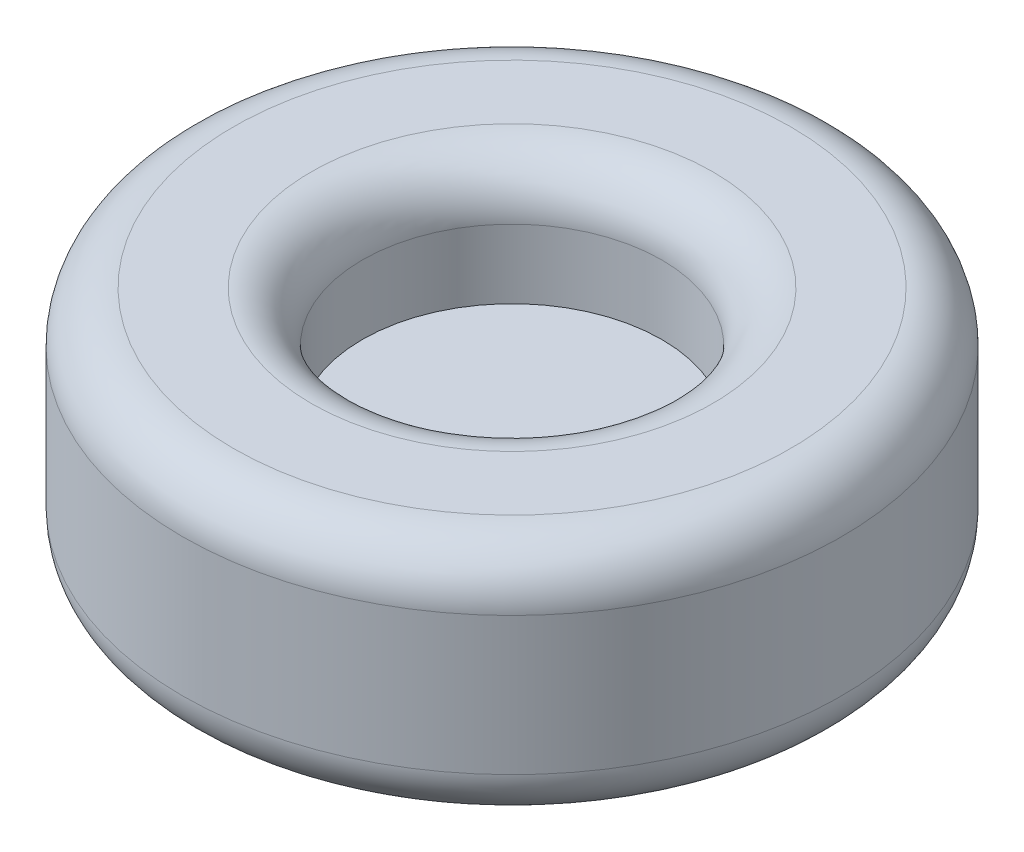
from build123d import *

# Parameters (mm, degrees)
BOSS_EXTRUDE1_DEPTH      = 114.3
BOSS_EXTRUDE1_DEPTH_BACK = 88.9
SKETCH1_R                = 279.4
FILLET1_R                = 43.18
SKETCH2_R                = 127
CUT_EXTRUDE1_DEPTH       = 101.6
FILLET2_R                = 43.18


with BuildPart() as part:
    # Sketch1 → Boss-Extrude1 (new, two sides: drawn at the far end of the back side and taken through both)
    with BuildSketch(Plane(origin=(0, 0, 0), x_dir=(1, 0, 0), z_dir=(0, 1, 0)).offset(-BOSS_EXTRUDE1_DEPTH_BACK)):
        with Locations(Location((0, 0, 0), (0, 0, 270))):
            Circle(SKETCH1_R)
    extrude(amount=BOSS_EXTRUDE1_DEPTH + BOSS_EXTRUDE1_DEPTH_BACK)

    # Fillet1
    fillet1_edges = [part.edges().sort_by_distance(p)[0] for p in [
        (0, -88.9, -279.4),
        (0, 114.3, -279.4),
    ]]
    fillet(fillet1_edges, radius=FILLET1_R)

    # Sketch2 → Cut-Extrude1 (cut)
    with BuildSketch(Plane(origin=(0, 114.3, 0), x_dir=(1, 0, 0), z_dir=(0, 1, 0))):
        with Locations(Location((0, 0, 0), (0, 0, 270))):
            Circle(SKETCH2_R)
    extrude(amount=-CUT_EXTRUDE1_DEPTH, mode=Mode.SUBTRACT)

    # Fillet2
    fillet2_edges = [part.edges().sort_by_distance(p)[0] for p in [
        (0, 114.3, -127),
    ]]
    fillet(fillet2_edges, radius=FILLET2_R)


solid = part.part
